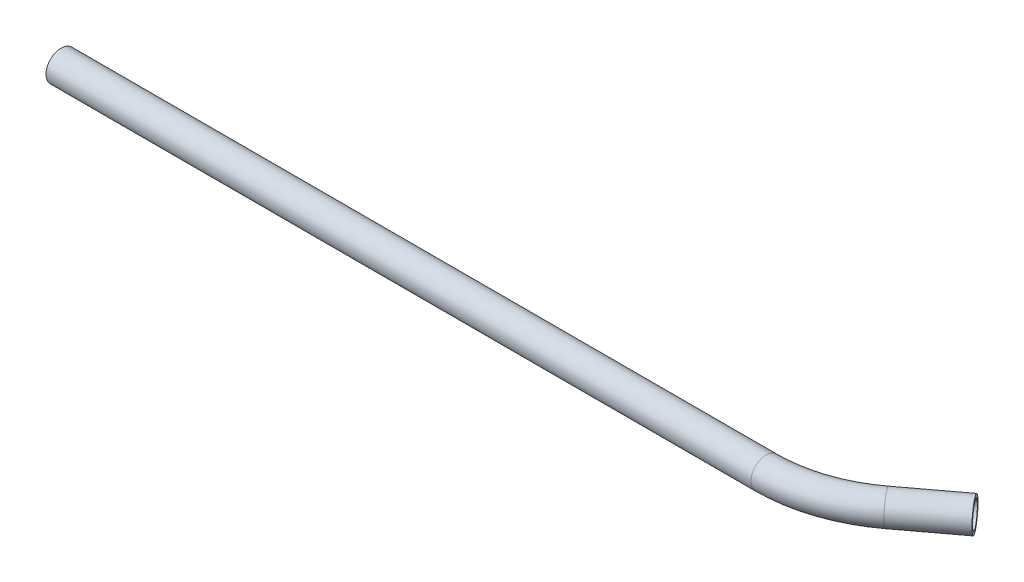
ISO-10303-21;
HEADER;
FILE_DESCRIPTION(('STEP AP214'),'2;1');
FILE_NAME('part.step','',(''),(''),'','','');
FILE_SCHEMA(('AUTOMOTIVE_DESIGN { 1 0 10303 214 1 1 1 1 }'));
ENDSEC;
DATA;
#1=APPLICATION_CONTEXT('core data for automotive mechanical design processes');
#2=APPLICATION_PROTOCOL_DEFINITION('international standard','automotive_design',2000,#1);
#3=PRODUCT_CONTEXT('',#1,'mechanical');
#4=PRODUCT('Part','Part','',(#3));
#5=PRODUCT_RELATED_PRODUCT_CATEGORY('part','',(#4));
#6=PRODUCT_DEFINITION_FORMATION('','',#4);
#7=PRODUCT_DEFINITION_CONTEXT('part definition',#1,'design');
#8=PRODUCT_DEFINITION('design','',#6,#7);
#9=PRODUCT_DEFINITION_SHAPE('','',#8);
#10=(LENGTH_UNIT() NAMED_UNIT(*) SI_UNIT(.MILLI.,.METRE.));
#11=(NAMED_UNIT(*) PLANE_ANGLE_UNIT() SI_UNIT($,.RADIAN.));
#12=(NAMED_UNIT(*) SI_UNIT($,.STERADIAN.) SOLID_ANGLE_UNIT());
#13=UNCERTAINTY_MEASURE_WITH_UNIT(LENGTH_MEASURE(1.E-05),#10,'distance_accuracy_value','');
#14=(GEOMETRIC_REPRESENTATION_CONTEXT(3) GLOBAL_UNCERTAINTY_ASSIGNED_CONTEXT((#13)) GLOBAL_UNIT_ASSIGNED_CONTEXT((#10,
#11,#12)) REPRESENTATION_CONTEXT('',''));
#15=CARTESIAN_POINT('',(0.,0.,0.));
#16=DIRECTION('',(0.,0.,1.));
#17=DIRECTION('',(1.,0.,0.));
#18=AXIS2_PLACEMENT_3D('',#15,#16,#17);
#19=CARTESIAN_POINT('',(52.6666666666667,0.,-2.00000000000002));
#20=DIRECTION('',(0.799999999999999,0.,-0.600000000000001));
#21=DIRECTION('',(-0.600000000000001,0.,-0.799999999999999));
#22=AXIS2_PLACEMENT_3D('',#19,#20,#21);
#23=CYLINDRICAL_SURFACE('',#22,1.);
#24=CARTESIAN_POINT('',(52.6666666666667,0.,-2.00000000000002));
#25=DIRECTION('',(0.799999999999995,0.,-0.600000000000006));
#26=DIRECTION('',(-0.600000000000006,0.,-0.799999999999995));
#27=AXIS2_PLACEMENT_3D('',#24,#25,#26);
#28=CIRCLE('',#27,1.);
#29=CARTESIAN_POINT('',(53.2666666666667,0.,-1.20000000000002));
#30=VERTEX_POINT('',#29);
#31=EDGE_CURVE('E38',#30,#30,#28,.T.);
#32=ORIENTED_EDGE('',*,*,#31,.T.);
#33=EDGE_LOOP('',(#32));
#34=FACE_BOUND('',#33,.T.);
#35=CARTESIAN_POINT('',(56.,0.,-4.5));
#36=DIRECTION('',(0.799999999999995,0.,-0.600000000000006));
#37=DIRECTION('',(-0.600000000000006,0.,-0.799999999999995));
#38=AXIS2_PLACEMENT_3D('',#35,#36,#37);
#39=CIRCLE('',#38,1.);
#40=CARTESIAN_POINT('',(55.4,0.,-5.29999999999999));
#41=VERTEX_POINT('',#40);
#42=EDGE_CURVE('E10',#41,#41,#39,.T.);
#43=ORIENTED_EDGE('',*,*,#42,.F.);
#44=EDGE_LOOP('',(#43));
#45=FACE_BOUND('',#44,.T.);
#46=ADVANCED_FACE('F28',(#34,#45),#23,.T.);
#47=CARTESIAN_POINT('',(52.6666666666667,0.,-2.00000000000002));
#48=DIRECTION('',(0.799999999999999,0.,-0.600000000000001));
#49=DIRECTION('',(-0.600000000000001,0.,-0.799999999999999));
#50=AXIS2_PLACEMENT_3D('',#47,#48,#49);
#51=CYLINDRICAL_SURFACE('',#50,0.8);
#52=CARTESIAN_POINT('',(52.6666666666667,0.,-2.00000000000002));
#53=DIRECTION('',(0.799999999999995,0.,-0.600000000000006));
#54=DIRECTION('',(-0.600000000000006,0.,-0.799999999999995));
#55=AXIS2_PLACEMENT_3D('',#52,#53,#54);
#56=CIRCLE('',#55,0.8);
#57=CARTESIAN_POINT('',(53.1466666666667,0.,-1.36000000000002));
#58=VERTEX_POINT('',#57);
#59=EDGE_CURVE('E42',#58,#58,#56,.T.);
#60=ORIENTED_EDGE('',*,*,#59,.F.);
#61=EDGE_LOOP('',(#60));
#62=FACE_BOUND('',#61,.T.);
#63=CARTESIAN_POINT('',(56.,0.,-4.5));
#64=DIRECTION('',(0.799999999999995,0.,-0.600000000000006));
#65=DIRECTION('',(-0.600000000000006,0.,-0.799999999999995));
#66=AXIS2_PLACEMENT_3D('',#63,#64,#65);
#67=CIRCLE('',#66,0.8);
#68=CARTESIAN_POINT('',(55.52,0.,-5.14));
#69=VERTEX_POINT('',#68);
#70=EDGE_CURVE('E34',#69,#69,#67,.T.);
#71=ORIENTED_EDGE('',*,*,#70,.T.);
#72=EDGE_LOOP('',(#71));
#73=FACE_BOUND('',#72,.T.);
#74=ADVANCED_FACE('F70',(#62,#73),#51,.F.);
#75=CARTESIAN_POINT('',(46.6666666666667,0.,-10.));
#76=DIRECTION('',(0.,1.,0.));
#77=DIRECTION('',(0.,0.,1.));
#78=AXIS2_PLACEMENT_3D('',#75,#76,#77);
#79=TOROIDAL_SURFACE('',#78,10.,1.);
#80=CARTESIAN_POINT('',(46.6666666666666,0.,0.));
#81=DIRECTION('',(1.,0.,0.));
#82=DIRECTION('',(0.,0.,-1.));
#83=AXIS2_PLACEMENT_3D('',#80,#81,#82);
#84=CIRCLE('',#83,1.);
#85=CARTESIAN_POINT('',(46.6666666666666,0.,1.));
#86=VERTEX_POINT('',#85);
#87=EDGE_CURVE('E47',#86,#86,#84,.T.);
#88=CARTESIAN_POINT('',(46.6666666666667,0.,-10.));
#89=DIRECTION('',(0.,1.,0.));
#90=DIRECTION('',(0.,0.,1.));
#91=AXIS2_PLACEMENT_3D('',#88,#89,#90);
#92=CIRCLE('',#91,11.);
#93=EDGE_CURVE('',#86,#30,#92,.T.);
#94=ORIENTED_EDGE('',*,*,#87,.T.);
#95=ORIENTED_EDGE('',*,*,#31,.F.);
#96=ORIENTED_EDGE('',*,*,#93,.T.);
#97=ORIENTED_EDGE('',*,*,#93,.F.);
#98=EDGE_LOOP('',(#94,#96,#95,#97));
#99=FACE_BOUND('',#98,.T.);
#100=ADVANCED_FACE('F66',(#99),#79,.T.);
#101=CARTESIAN_POINT('',(46.6666666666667,0.,-10.));
#102=DIRECTION('',(0.,1.,0.));
#103=DIRECTION('',(0.,0.,1.));
#104=AXIS2_PLACEMENT_3D('',#101,#102,#103);
#105=TOROIDAL_SURFACE('',#104,10.,0.8);
#106=CARTESIAN_POINT('',(46.6666666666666,0.,0.));
#107=DIRECTION('',(1.,0.,0.));
#108=DIRECTION('',(0.,0.,-1.));
#109=AXIS2_PLACEMENT_3D('',#106,#107,#108);
#110=CIRCLE('',#109,0.8);
#111=CARTESIAN_POINT('',(46.6666666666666,0.,0.8));
#112=VERTEX_POINT('',#111);
#113=EDGE_CURVE('E51',#112,#112,#110,.T.);
#114=CARTESIAN_POINT('',(46.6666666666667,0.,-10.));
#115=DIRECTION('',(0.,1.,0.));
#116=DIRECTION('',(0.,0.,1.));
#117=AXIS2_PLACEMENT_3D('',#114,#115,#116);
#118=CIRCLE('',#117,10.8);
#119=EDGE_CURVE('',#112,#58,#118,.T.);
#120=ORIENTED_EDGE('',*,*,#113,.F.);
#121=ORIENTED_EDGE('',*,*,#59,.T.);
#122=ORIENTED_EDGE('',*,*,#119,.T.);
#123=ORIENTED_EDGE('',*,*,#119,.F.);
#124=EDGE_LOOP('',(#120,#122,#121,#123));
#125=FACE_BOUND('',#124,.T.);
#126=ADVANCED_FACE('F63',(#125),#105,.F.);
#127=CARTESIAN_POINT('',(46.6666666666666,0.,0.));
#128=DIRECTION('',(-1.,0.,0.));
#129=DIRECTION('',(0.,0.,1.));
#130=AXIS2_PLACEMENT_3D('',#127,#128,#129);
#131=CYLINDRICAL_SURFACE('',#130,0.8);
#132=ORIENTED_EDGE('',*,*,#113,.T.);
#133=EDGE_LOOP('',(#132));
#134=FACE_BOUND('',#133,.T.);
#135=CARTESIAN_POINT('',(0.,0.,0.));
#136=DIRECTION('',(1.,0.,0.));
#137=DIRECTION('',(0.,0.,-1.));
#138=AXIS2_PLACEMENT_3D('',#135,#136,#137);
#139=CIRCLE('',#138,0.8);
#140=CARTESIAN_POINT('',(0.,0.,-0.8));
#141=VERTEX_POINT('',#140);
#142=EDGE_CURVE('E52',#141,#141,#139,.T.);
#143=ORIENTED_EDGE('',*,*,#142,.F.);
#144=EDGE_LOOP('',(#143));
#145=FACE_BOUND('',#144,.T.);
#146=ADVANCED_FACE('F60',(#134,#145),#131,.F.);
#147=CARTESIAN_POINT('',(46.6666666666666,0.,0.));
#148=DIRECTION('',(-1.,0.,0.));
#149=DIRECTION('',(0.,0.,1.));
#150=AXIS2_PLACEMENT_3D('',#147,#148,#149);
#151=CYLINDRICAL_SURFACE('',#150,1.);
#152=ORIENTED_EDGE('',*,*,#87,.F.);
#153=EDGE_LOOP('',(#152));
#154=FACE_BOUND('',#153,.T.);
#155=CARTESIAN_POINT('',(0.,0.,0.));
#156=DIRECTION('',(1.,0.,0.));
#157=DIRECTION('',(0.,0.,-1.));
#158=AXIS2_PLACEMENT_3D('',#155,#156,#157);
#159=CIRCLE('',#158,1.);
#160=CARTESIAN_POINT('',(0.,0.,-1.));
#161=VERTEX_POINT('',#160);
#162=EDGE_CURVE('E48',#161,#161,#159,.T.);
#163=ORIENTED_EDGE('',*,*,#162,.T.);
#164=EDGE_LOOP('',(#163));
#165=FACE_BOUND('',#164,.T.);
#166=ADVANCED_FACE('F82',(#154,#165),#151,.T.);
#167=CARTESIAN_POINT('',(56.,0.,-4.5));
#168=DIRECTION('',(0.799999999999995,0.,-0.600000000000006));
#169=DIRECTION('',(-0.600000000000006,0.,-0.799999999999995));
#170=AXIS2_PLACEMENT_3D('',#167,#168,#169);
#171=PLANE('',#170);
#172=ORIENTED_EDGE('',*,*,#70,.F.);
#173=EDGE_LOOP('',(#172));
#174=FACE_BOUND('',#173,.T.);
#175=ORIENTED_EDGE('',*,*,#42,.T.);
#176=EDGE_LOOP('',(#175));
#177=FACE_BOUND('',#176,.T.);
#178=ADVANCED_FACE('F85',(#174,#177),#171,.T.);
#179=CARTESIAN_POINT('',(0.,0.,0.));
#180=DIRECTION('',(1.,0.,0.));
#181=DIRECTION('',(0.,0.,-1.));
#182=AXIS2_PLACEMENT_3D('',#179,#180,#181);
#183=PLANE('',#182);
#184=ORIENTED_EDGE('',*,*,#142,.T.);
#185=EDGE_LOOP('',(#184));
#186=FACE_BOUND('',#185,.T.);
#187=ORIENTED_EDGE('',*,*,#162,.F.);
#188=EDGE_LOOP('',(#187));
#189=FACE_BOUND('',#188,.T.);
#190=ADVANCED_FACE('F87',(#186,#189),#183,.F.);
#191=CLOSED_SHELL('',(#46,#74,#100,#126,#146,#166,#178,#190));
#192=MANIFOLD_SOLID_BREP('B2',#191);
#193=ADVANCED_BREP_SHAPE_REPRESENTATION('',(#18,#192),#14);
#194=SHAPE_DEFINITION_REPRESENTATION(#9,#193);
ENDSEC;
END-ISO-10303-21;
